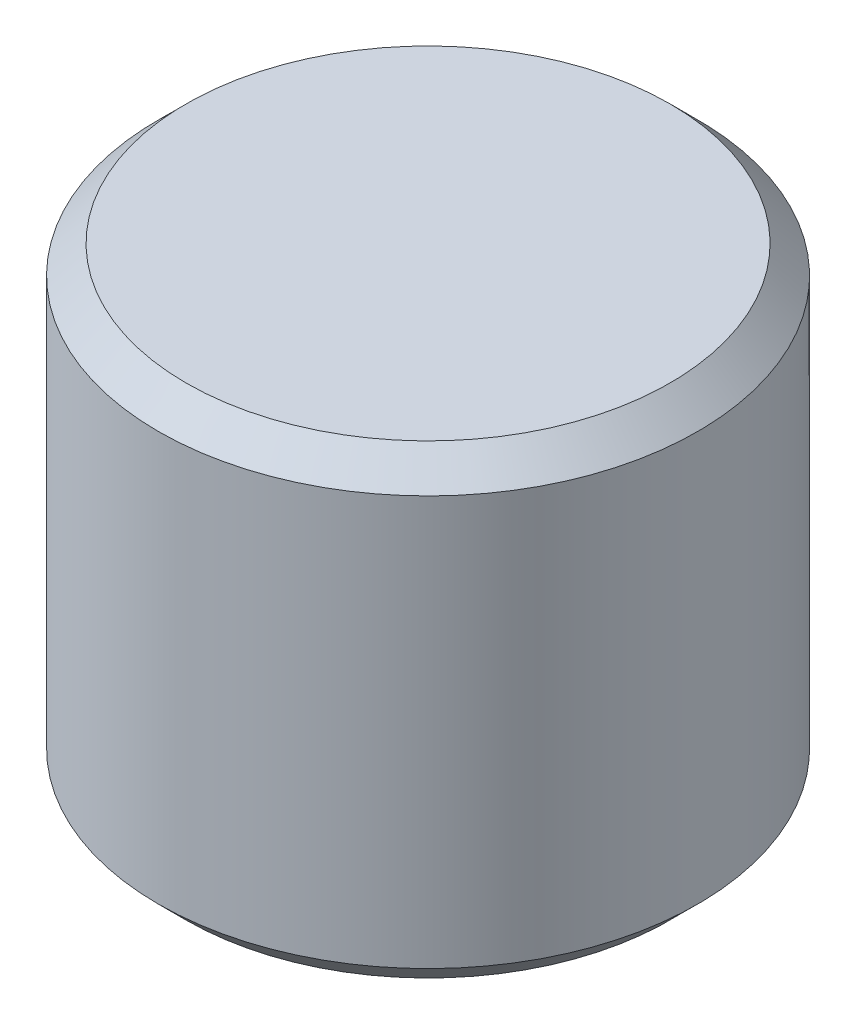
ISO-10303-21;
HEADER;
FILE_DESCRIPTION(('STEP AP214'),'2;1');
FILE_NAME('part.step','',(''),(''),'','','');
FILE_SCHEMA(('AUTOMOTIVE_DESIGN { 1 0 10303 214 1 1 1 1 }'));
ENDSEC;
DATA;
#1=APPLICATION_CONTEXT('core data for automotive mechanical design processes');
#2=APPLICATION_PROTOCOL_DEFINITION('international standard','automotive_design',2000,#1);
#3=PRODUCT_CONTEXT('',#1,'mechanical');
#4=PRODUCT('Part','Part','',(#3));
#5=PRODUCT_RELATED_PRODUCT_CATEGORY('part','',(#4));
#6=PRODUCT_DEFINITION_FORMATION('','',#4);
#7=PRODUCT_DEFINITION_CONTEXT('part definition',#1,'design');
#8=PRODUCT_DEFINITION('design','',#6,#7);
#9=PRODUCT_DEFINITION_SHAPE('','',#8);
#10=(LENGTH_UNIT() NAMED_UNIT(*) SI_UNIT(.MILLI.,.METRE.));
#11=(NAMED_UNIT(*) PLANE_ANGLE_UNIT() SI_UNIT($,.RADIAN.));
#12=(NAMED_UNIT(*) SI_UNIT($,.STERADIAN.) SOLID_ANGLE_UNIT());
#13=UNCERTAINTY_MEASURE_WITH_UNIT(LENGTH_MEASURE(1.E-05),#10,'distance_accuracy_value','');
#14=(GEOMETRIC_REPRESENTATION_CONTEXT(3) GLOBAL_UNCERTAINTY_ASSIGNED_CONTEXT((#13)) GLOBAL_UNIT_ASSIGNED_CONTEXT((#10,
#11,#12)) REPRESENTATION_CONTEXT('',''));
#15=CARTESIAN_POINT('',(0.,0.,0.));
#16=DIRECTION('',(0.,0.,1.));
#17=DIRECTION('',(1.,0.,0.));
#18=AXIS2_PLACEMENT_3D('',#15,#16,#17);
#19=CARTESIAN_POINT('',(0.,25.,0.));
#20=DIRECTION('',(0.,-1.,0.));
#21=DIRECTION('',(0.,0.,-1.));
#22=AXIS2_PLACEMENT_3D('',#19,#20,#21);
#23=CYLINDRICAL_SURFACE('',#22,14.5);
#24=CARTESIAN_POINT('',(0.,1.5,0.));
#25=DIRECTION('',(0.,1.,0.));
#26=DIRECTION('',(0.,0.,1.));
#27=AXIS2_PLACEMENT_3D('',#24,#25,#26);
#28=CIRCLE('',#27,14.5);
#29=CARTESIAN_POINT('',(0.,1.5,14.5));
#30=VERTEX_POINT('',#29);
#31=EDGE_CURVE('E43',#30,#30,#28,.T.);
#32=ORIENTED_EDGE('',*,*,#31,.T.);
#33=EDGE_LOOP('',(#32));
#34=FACE_BOUND('',#33,.T.);
#35=CARTESIAN_POINT('',(0.,23.5,0.));
#36=DIRECTION('',(0.,1.,0.));
#37=DIRECTION('',(0.,0.,1.));
#38=AXIS2_PLACEMENT_3D('',#35,#36,#37);
#39=CIRCLE('',#38,14.5);
#40=CARTESIAN_POINT('',(0.,23.5,14.5));
#41=VERTEX_POINT('',#40);
#42=EDGE_CURVE('E47',#41,#41,#39,.F.);
#43=ORIENTED_EDGE('',*,*,#42,.T.);
#44=EDGE_LOOP('',(#43));
#45=FACE_BOUND('',#44,.T.);
#46=ADVANCED_FACE('F32',(#34,#45),#23,.T.);
#47=CARTESIAN_POINT('',(0.,25.,0.));
#48=DIRECTION('',(0.,1.,0.));
#49=DIRECTION('',(0.,0.,1.));
#50=AXIS2_PLACEMENT_3D('',#47,#48,#49);
#51=PLANE('',#50);
#52=CARTESIAN_POINT('',(0.,25.,0.));
#53=DIRECTION('',(0.,1.,0.));
#54=DIRECTION('',(0.,0.,1.));
#55=AXIS2_PLACEMENT_3D('',#52,#53,#54);
#56=CIRCLE('',#55,13.);
#57=CARTESIAN_POINT('',(0.,25.,13.));
#58=VERTEX_POINT('',#57);
#59=EDGE_CURVE('E10',#58,#58,#56,.T.);
#60=ORIENTED_EDGE('',*,*,#59,.T.);
#61=EDGE_LOOP('',(#60));
#62=FACE_BOUND('',#61,.T.);
#63=ADVANCED_FACE('F63',(#62),#51,.T.);
#64=CARTESIAN_POINT('',(0.,0.,0.));
#65=DIRECTION('',(0.,1.,0.));
#66=DIRECTION('',(0.,0.,1.));
#67=AXIS2_PLACEMENT_3D('',#64,#65,#66);
#68=PLANE('',#67);
#69=CARTESIAN_POINT('',(0.,0.,0.));
#70=DIRECTION('',(0.,1.,0.));
#71=DIRECTION('',(0.,0.,1.));
#72=AXIS2_PLACEMENT_3D('',#69,#70,#71);
#73=CIRCLE('',#72,13.);
#74=CARTESIAN_POINT('',(0.,0.,13.));
#75=VERTEX_POINT('',#74);
#76=EDGE_CURVE('E39',#75,#75,#73,.F.);
#77=ORIENTED_EDGE('',*,*,#76,.T.);
#78=EDGE_LOOP('',(#77));
#79=FACE_BOUND('',#78,.T.);
#80=ADVANCED_FACE('F60',(#79),#68,.F.);
#81=CARTESIAN_POINT('',(0.,1.5,0.));
#82=DIRECTION('',(0.,1.,0.));
#83=DIRECTION('',(0.,0.,1.));
#84=AXIS2_PLACEMENT_3D('',#81,#82,#83);
#85=CONICAL_SURFACE('',#84,14.5,0.78539816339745);
#86=ORIENTED_EDGE('',*,*,#76,.F.);
#87=EDGE_LOOP('',(#86));
#88=FACE_BOUND('',#87,.T.);
#89=ORIENTED_EDGE('',*,*,#31,.F.);
#90=EDGE_LOOP('',(#89));
#91=FACE_BOUND('',#90,.T.);
#92=ADVANCED_FACE('F56',(#88,#91),#85,.T.);
#93=CARTESIAN_POINT('',(0.,25.,0.));
#94=DIRECTION('',(0.,-1.,0.));
#95=DIRECTION('',(0.,0.,-1.));
#96=AXIS2_PLACEMENT_3D('',#93,#94,#95);
#97=CONICAL_SURFACE('',#96,13.,0.785398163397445);
#98=ORIENTED_EDGE('',*,*,#42,.F.);
#99=EDGE_LOOP('',(#98));
#100=FACE_BOUND('',#99,.T.);
#101=ORIENTED_EDGE('',*,*,#59,.F.);
#102=EDGE_LOOP('',(#101));
#103=FACE_BOUND('',#102,.T.);
#104=ADVANCED_FACE('F34',(#100,#103),#97,.T.);
#105=CLOSED_SHELL('',(#46,#63,#80,#92,#104));
#106=MANIFOLD_SOLID_BREP('B2',#105);
#107=ADVANCED_BREP_SHAPE_REPRESENTATION('',(#18,#106),#14);
#108=SHAPE_DEFINITION_REPRESENTATION(#9,#107);
ENDSEC;
END-ISO-10303-21;
